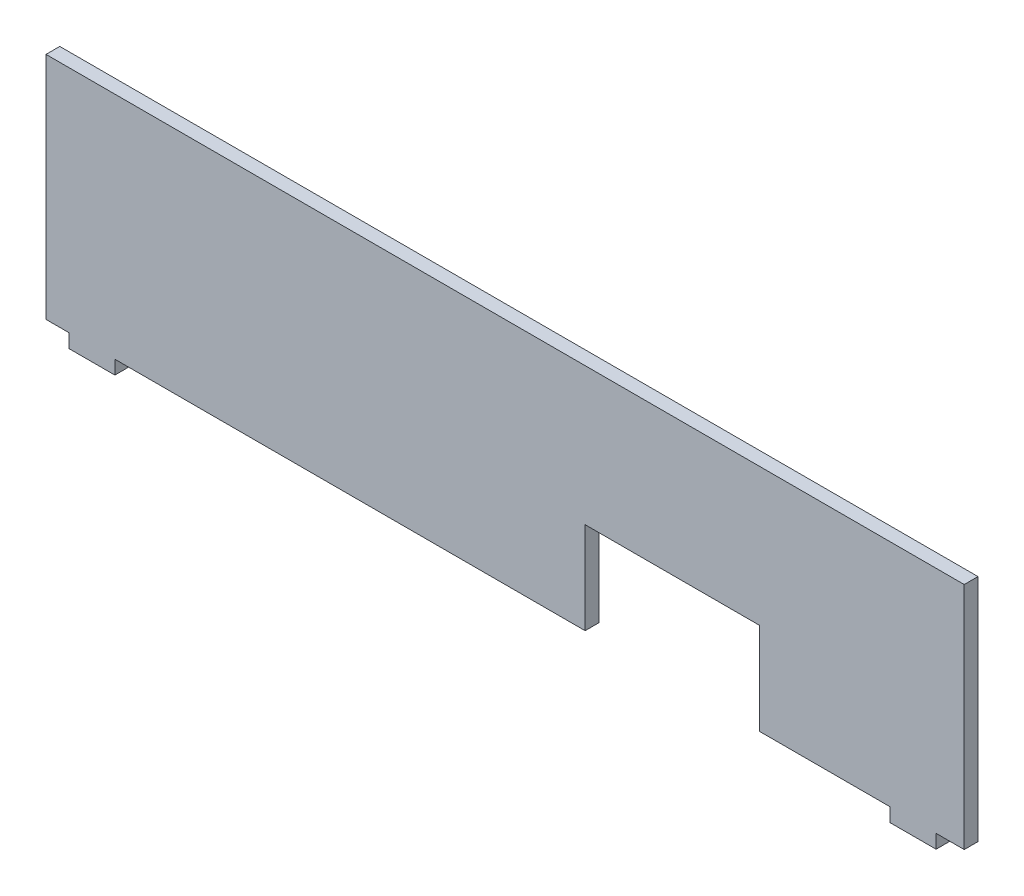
ISO-10303-21;
HEADER;
FILE_DESCRIPTION(('STEP AP214'),'2;1');
FILE_NAME('part.step','',(''),(''),'','','');
FILE_SCHEMA(('AUTOMOTIVE_DESIGN { 1 0 10303 214 1 1 1 1 }'));
ENDSEC;
DATA;
#1=APPLICATION_CONTEXT('core data for automotive mechanical design processes');
#2=APPLICATION_PROTOCOL_DEFINITION('international standard','automotive_design',2000,#1);
#3=PRODUCT_CONTEXT('',#1,'mechanical');
#4=PRODUCT('Part','Part','',(#3));
#5=PRODUCT_RELATED_PRODUCT_CATEGORY('part','',(#4));
#6=PRODUCT_DEFINITION_FORMATION('','',#4);
#7=PRODUCT_DEFINITION_CONTEXT('part definition',#1,'design');
#8=PRODUCT_DEFINITION('design','',#6,#7);
#9=PRODUCT_DEFINITION_SHAPE('','',#8);
#10=(LENGTH_UNIT() NAMED_UNIT(*) SI_UNIT(.MILLI.,.METRE.));
#11=(NAMED_UNIT(*) PLANE_ANGLE_UNIT() SI_UNIT($,.RADIAN.));
#12=(NAMED_UNIT(*) SI_UNIT($,.STERADIAN.) SOLID_ANGLE_UNIT());
#13=UNCERTAINTY_MEASURE_WITH_UNIT(LENGTH_MEASURE(1.E-05),#10,'distance_accuracy_value','');
#14=(GEOMETRIC_REPRESENTATION_CONTEXT(3) GLOBAL_UNCERTAINTY_ASSIGNED_CONTEXT((#13)) GLOBAL_UNIT_ASSIGNED_CONTEXT((#10,
#11,#12)) REPRESENTATION_CONTEXT('',''));
#15=CARTESIAN_POINT('',(0.,0.,0.));
#16=DIRECTION('',(0.,0.,1.));
#17=DIRECTION('',(1.,0.,0.));
#18=AXIS2_PLACEMENT_3D('',#15,#16,#17);
#19=CARTESIAN_POINT('',(-62.4906588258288,-16.8654181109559,3.));
#20=DIRECTION('',(1.,0.,0.));
#21=DIRECTION('',(0.,0.,-1.));
#22=AXIS2_PLACEMENT_3D('',#19,#20,#21);
#23=PLANE('',#22);
#24=DIRECTION('',(0.,-1.,0.));
#25=VECTOR('',#24,1.);
#26=CARTESIAN_POINT('',(-62.4906588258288,-16.8654181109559,0.));
#27=LINE('',#26,#25);
#28=CARTESIAN_POINT('',(-62.4906588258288,33.1345818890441,0.));
#29=VERTEX_POINT('',#28);
#30=CARTESIAN_POINT('',(-62.4906588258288,-16.8654181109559,0.));
#31=VERTEX_POINT('',#30);
#32=EDGE_CURVE('E177',#29,#31,#27,.T.);
#33=ORIENTED_EDGE('',*,*,#32,.T.);
#34=DIRECTION('',(0.,0.,-1.));
#35=VECTOR('',#34,1.);
#36=CARTESIAN_POINT('',(-62.4906588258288,-16.8654181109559,3.));
#37=LINE('',#36,#35);
#38=CARTESIAN_POINT('',(-62.4906588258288,-16.8654181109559,3.));
#39=VERTEX_POINT('',#38);
#40=EDGE_CURVE('E11',#39,#31,#37,.T.);
#41=ORIENTED_EDGE('',*,*,#40,.F.);
#42=DIRECTION('',(0.,-1.,0.));
#43=VECTOR('',#42,1.);
#44=CARTESIAN_POINT('',(-62.4906588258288,-16.8654181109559,3.));
#45=LINE('',#44,#43);
#46=CARTESIAN_POINT('',(-62.4906588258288,33.1345818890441,3.));
#47=VERTEX_POINT('',#46);
#48=EDGE_CURVE('E207',#47,#39,#45,.T.);
#49=ORIENTED_EDGE('',*,*,#48,.F.);
#50=DIRECTION('',(0.,0.,-1.));
#51=VECTOR('',#50,1.);
#52=CARTESIAN_POINT('',(-62.4906588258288,33.1345818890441,3.));
#53=LINE('',#52,#51);
#54=EDGE_CURVE('E173',#47,#29,#53,.T.);
#55=ORIENTED_EDGE('',*,*,#54,.T.);
#56=EDGE_LOOP('',(#33,#41,#49,#55));
#57=FACE_BOUND('',#56,.T.);
#58=ADVANCED_FACE('F33',(#57),#23,.F.);
#59=CARTESIAN_POINT('',(-62.4906588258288,-16.8654181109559,3.));
#60=DIRECTION('',(0.,1.,0.));
#61=DIRECTION('',(-1.,0.,0.));
#62=AXIS2_PLACEMENT_3D('',#59,#60,#61);
#63=PLANE('',#62);
#64=DIRECTION('',(1.,0.,0.));
#65=VECTOR('',#64,1.);
#66=CARTESIAN_POINT('',(-62.4906588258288,-16.8654181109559,0.));
#67=LINE('',#66,#65);
#68=CARTESIAN_POINT('',(-57.4906588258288,-16.8654181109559,0.));
#69=VERTEX_POINT('',#68);
#70=EDGE_CURVE('E180',#31,#69,#67,.T.);
#71=ORIENTED_EDGE('',*,*,#70,.T.);
#72=DIRECTION('',(0.,0.,-1.));
#73=VECTOR('',#72,1.);
#74=CARTESIAN_POINT('',(-57.4906588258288,-16.8654181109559,3.));
#75=LINE('',#74,#73);
#76=CARTESIAN_POINT('',(-57.4906588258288,-16.8654181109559,3.));
#77=VERTEX_POINT('',#76);
#78=EDGE_CURVE('E41',#77,#69,#75,.T.);
#79=ORIENTED_EDGE('',*,*,#78,.F.);
#80=DIRECTION('',(1.,0.,0.));
#81=VECTOR('',#80,1.);
#82=CARTESIAN_POINT('',(-62.4906588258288,-16.8654181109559,3.));
#83=LINE('',#82,#81);
#84=EDGE_CURVE('E116',#39,#77,#83,.T.);
#85=ORIENTED_EDGE('',*,*,#84,.F.);
#86=ORIENTED_EDGE('',*,*,#40,.T.);
#87=EDGE_LOOP('',(#71,#79,#85,#86));
#88=FACE_BOUND('',#87,.T.);
#89=ADVANCED_FACE('F305',(#88),#63,.F.);
#90=CARTESIAN_POINT('',(-57.4906588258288,-16.8654181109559,3.));
#91=DIRECTION('',(1.,0.,0.));
#92=DIRECTION('',(0.,0.,-1.));
#93=AXIS2_PLACEMENT_3D('',#90,#91,#92);
#94=PLANE('',#93);
#95=DIRECTION('',(0.,-1.,0.));
#96=VECTOR('',#95,1.);
#97=CARTESIAN_POINT('',(-57.4906588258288,-16.8654181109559,0.));
#98=LINE('',#97,#96);
#99=CARTESIAN_POINT('',(-57.4906588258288,-19.8654181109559,0.));
#100=VERTEX_POINT('',#99);
#101=EDGE_CURVE('E182',#69,#100,#98,.T.);
#102=ORIENTED_EDGE('',*,*,#101,.T.);
#103=DIRECTION('',(0.,0.,-1.));
#104=VECTOR('',#103,1.);
#105=CARTESIAN_POINT('',(-57.4906588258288,-19.8654181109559,3.));
#106=LINE('',#105,#104);
#107=CARTESIAN_POINT('',(-57.4906588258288,-19.8654181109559,3.));
#108=VERTEX_POINT('',#107);
#109=EDGE_CURVE('E238',#108,#100,#106,.T.);
#110=ORIENTED_EDGE('',*,*,#109,.F.);
#111=DIRECTION('',(0.,-1.,0.));
#112=VECTOR('',#111,1.);
#113=CARTESIAN_POINT('',(-57.4906588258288,-16.8654181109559,3.));
#114=LINE('',#113,#112);
#115=EDGE_CURVE('E246',#77,#108,#114,.T.);
#116=ORIENTED_EDGE('',*,*,#115,.F.);
#117=ORIENTED_EDGE('',*,*,#78,.T.);
#118=EDGE_LOOP('',(#102,#110,#116,#117));
#119=FACE_BOUND('',#118,.T.);
#120=ADVANCED_FACE('F244',(#119),#94,.F.);
#121=CARTESIAN_POINT('',(-57.4906588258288,-19.8654181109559,3.));
#122=DIRECTION('',(0.,1.,0.));
#123=DIRECTION('',(0.,0.,1.));
#124=AXIS2_PLACEMENT_3D('',#121,#122,#123);
#125=PLANE('',#124);
#126=DIRECTION('',(1.,0.,0.));
#127=VECTOR('',#126,1.);
#128=CARTESIAN_POINT('',(-57.4906588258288,-19.8654181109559,0.));
#129=LINE('',#128,#127);
#130=CARTESIAN_POINT('',(-47.4906588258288,-19.8654181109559,0.));
#131=VERTEX_POINT('',#130);
#132=EDGE_CURVE('E184',#100,#131,#129,.T.);
#133=ORIENTED_EDGE('',*,*,#132,.T.);
#134=DIRECTION('',(0.,0.,-1.));
#135=VECTOR('',#134,1.);
#136=CARTESIAN_POINT('',(-47.4906588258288,-19.8654181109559,3.));
#137=LINE('',#136,#135);
#138=CARTESIAN_POINT('',(-47.4906588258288,-19.8654181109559,3.));
#139=VERTEX_POINT('',#138);
#140=EDGE_CURVE('E235',#139,#131,#137,.T.);
#141=ORIENTED_EDGE('',*,*,#140,.F.);
#142=DIRECTION('',(1.,0.,0.));
#143=VECTOR('',#142,1.);
#144=CARTESIAN_POINT('',(-57.4906588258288,-19.8654181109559,3.));
#145=LINE('',#144,#143);
#146=EDGE_CURVE('E264',#108,#139,#145,.T.);
#147=ORIENTED_EDGE('',*,*,#146,.F.);
#148=ORIENTED_EDGE('',*,*,#109,.T.);
#149=EDGE_LOOP('',(#133,#141,#147,#148));
#150=FACE_BOUND('',#149,.T.);
#151=ADVANCED_FACE('F255',(#150),#125,.F.);
#152=CARTESIAN_POINT('',(-47.4906588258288,-19.8654181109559,3.));
#153=DIRECTION('',(-1.,0.,0.));
#154=DIRECTION('',(0.,-1.,0.));
#155=AXIS2_PLACEMENT_3D('',#152,#153,#154);
#156=PLANE('',#155);
#157=DIRECTION('',(0.,1.,0.));
#158=VECTOR('',#157,1.);
#159=CARTESIAN_POINT('',(-47.4906588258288,-19.8654181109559,0.));
#160=LINE('',#159,#158);
#161=CARTESIAN_POINT('',(-47.4906588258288,-16.8654181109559,0.));
#162=VERTEX_POINT('',#161);
#163=EDGE_CURVE('E186',#131,#162,#160,.T.);
#164=ORIENTED_EDGE('',*,*,#163,.T.);
#165=DIRECTION('',(0.,0.,-1.));
#166=VECTOR('',#165,1.);
#167=CARTESIAN_POINT('',(-47.4906588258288,-16.8654181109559,3.));
#168=LINE('',#167,#166);
#169=CARTESIAN_POINT('',(-47.4906588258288,-16.8654181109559,3.));
#170=VERTEX_POINT('',#169);
#171=EDGE_CURVE('E232',#170,#162,#168,.T.);
#172=ORIENTED_EDGE('',*,*,#171,.F.);
#173=DIRECTION('',(0.,1.,0.));
#174=VECTOR('',#173,1.);
#175=CARTESIAN_POINT('',(-47.4906588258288,-19.8654181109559,3.));
#176=LINE('',#175,#174);
#177=EDGE_CURVE('E261',#139,#170,#176,.T.);
#178=ORIENTED_EDGE('',*,*,#177,.F.);
#179=ORIENTED_EDGE('',*,*,#140,.T.);
#180=EDGE_LOOP('',(#164,#172,#178,#179));
#181=FACE_BOUND('',#180,.T.);
#182=ADVANCED_FACE('F259',(#181),#156,.F.);
#183=CARTESIAN_POINT('',(-47.4906588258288,-16.8654181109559,3.));
#184=DIRECTION('',(0.,1.,0.));
#185=DIRECTION('',(0.,0.,1.));
#186=AXIS2_PLACEMENT_3D('',#183,#184,#185);
#187=PLANE('',#186);
#188=DIRECTION('',(1.,0.,0.));
#189=VECTOR('',#188,1.);
#190=CARTESIAN_POINT('',(-47.4906588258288,-16.8654181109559,0.));
#191=LINE('',#190,#189);
#192=CARTESIAN_POINT('',(54.9397347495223,-16.8654181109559,0.));
#193=VERTEX_POINT('',#192);
#194=EDGE_CURVE('E188',#162,#193,#191,.T.);
#195=ORIENTED_EDGE('',*,*,#194,.T.);
#196=DIRECTION('',(0.,0.,-1.));
#197=VECTOR('',#196,1.);
#198=CARTESIAN_POINT('',(54.9397347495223,-16.8654181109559,3.));
#199=LINE('',#198,#197);
#200=CARTESIAN_POINT('',(54.9397347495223,-16.8654181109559,3.));
#201=VERTEX_POINT('',#200);
#202=EDGE_CURVE('E229',#201,#193,#199,.T.);
#203=ORIENTED_EDGE('',*,*,#202,.F.);
#204=DIRECTION('',(1.,0.,0.));
#205=VECTOR('',#204,1.);
#206=CARTESIAN_POINT('',(-47.4906588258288,-16.8654181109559,3.));
#207=LINE('',#206,#205);
#208=EDGE_CURVE('E263',#170,#201,#207,.T.);
#209=ORIENTED_EDGE('',*,*,#208,.F.);
#210=ORIENTED_EDGE('',*,*,#171,.T.);
#211=EDGE_LOOP('',(#195,#203,#209,#210));
#212=FACE_BOUND('',#211,.T.);
#213=ADVANCED_FACE('F318',(#212),#187,.F.);
#214=CARTESIAN_POINT('',(54.9397347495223,3.1345818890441,3.));
#215=DIRECTION('',(-1.,0.,0.));
#216=DIRECTION('',(0.,0.,1.));
#217=AXIS2_PLACEMENT_3D('',#214,#215,#216);
#218=PLANE('',#217);
#219=DIRECTION('',(0.,1.,0.));
#220=VECTOR('',#219,1.);
#221=CARTESIAN_POINT('',(54.9397347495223,3.1345818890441,0.));
#222=LINE('',#221,#220);
#223=CARTESIAN_POINT('',(54.9397347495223,3.1345818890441,0.));
#224=VERTEX_POINT('',#223);
#225=EDGE_CURVE('E190',#193,#224,#222,.T.);
#226=ORIENTED_EDGE('',*,*,#225,.T.);
#227=DIRECTION('',(0.,0.,-1.));
#228=VECTOR('',#227,1.);
#229=CARTESIAN_POINT('',(54.9397347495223,3.1345818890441,3.));
#230=LINE('',#229,#228);
#231=CARTESIAN_POINT('',(54.9397347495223,3.1345818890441,3.));
#232=VERTEX_POINT('',#231);
#233=EDGE_CURVE('E226',#232,#224,#230,.T.);
#234=ORIENTED_EDGE('',*,*,#233,.F.);
#235=DIRECTION('',(0.,1.,0.));
#236=VECTOR('',#235,1.);
#237=CARTESIAN_POINT('',(54.9397347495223,3.1345818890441,3.));
#238=LINE('',#237,#236);
#239=EDGE_CURVE('E266',#201,#232,#238,.T.);
#240=ORIENTED_EDGE('',*,*,#239,.F.);
#241=ORIENTED_EDGE('',*,*,#202,.T.);
#242=EDGE_LOOP('',(#226,#234,#240,#241));
#243=FACE_BOUND('',#242,.T.);
#244=ADVANCED_FACE('F321',(#243),#218,.F.);
#245=CARTESIAN_POINT('',(92.9397347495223,3.1345818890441,3.));
#246=DIRECTION('',(0.,1.,0.));
#247=DIRECTION('',(0.,0.,1.));
#248=AXIS2_PLACEMENT_3D('',#245,#246,#247);
#249=PLANE('',#248);
#250=DIRECTION('',(1.,0.,0.));
#251=VECTOR('',#250,1.);
#252=CARTESIAN_POINT('',(92.9397347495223,3.1345818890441,0.));
#253=LINE('',#252,#251);
#254=CARTESIAN_POINT('',(92.9397347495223,3.1345818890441,0.));
#255=VERTEX_POINT('',#254);
#256=EDGE_CURVE('E192',#224,#255,#253,.T.);
#257=ORIENTED_EDGE('',*,*,#256,.T.);
#258=DIRECTION('',(0.,0.,-1.));
#259=VECTOR('',#258,1.);
#260=CARTESIAN_POINT('',(92.9397347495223,3.1345818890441,3.));
#261=LINE('',#260,#259);
#262=CARTESIAN_POINT('',(92.9397347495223,3.1345818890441,3.));
#263=VERTEX_POINT('',#262);
#264=EDGE_CURVE('E223',#263,#255,#261,.T.);
#265=ORIENTED_EDGE('',*,*,#264,.F.);
#266=DIRECTION('',(1.,0.,0.));
#267=VECTOR('',#266,1.);
#268=CARTESIAN_POINT('',(92.9397347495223,3.1345818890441,3.));
#269=LINE('',#268,#267);
#270=EDGE_CURVE('E272',#232,#263,#269,.T.);
#271=ORIENTED_EDGE('',*,*,#270,.F.);
#272=ORIENTED_EDGE('',*,*,#233,.T.);
#273=EDGE_LOOP('',(#257,#265,#271,#272));
#274=FACE_BOUND('',#273,.T.);
#275=ADVANCED_FACE('F325',(#274),#249,.F.);
#276=CARTESIAN_POINT('',(92.9397347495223,-16.8654181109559,3.));
#277=DIRECTION('',(1.,0.,0.));
#278=DIRECTION('',(0.,0.,-1.));
#279=AXIS2_PLACEMENT_3D('',#276,#277,#278);
#280=PLANE('',#279);
#281=DIRECTION('',(0.,-1.,0.));
#282=VECTOR('',#281,1.);
#283=CARTESIAN_POINT('',(92.9397347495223,-16.8654181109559,0.));
#284=LINE('',#283,#282);
#285=CARTESIAN_POINT('',(92.9397347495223,-16.8654181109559,0.));
#286=VERTEX_POINT('',#285);
#287=EDGE_CURVE('E194',#255,#286,#284,.T.);
#288=ORIENTED_EDGE('',*,*,#287,.T.);
#289=DIRECTION('',(0.,0.,-1.));
#290=VECTOR('',#289,1.);
#291=CARTESIAN_POINT('',(92.9397347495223,-16.8654181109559,3.));
#292=LINE('',#291,#290);
#293=CARTESIAN_POINT('',(92.9397347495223,-16.8654181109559,3.));
#294=VERTEX_POINT('',#293);
#295=EDGE_CURVE('E220',#294,#286,#292,.T.);
#296=ORIENTED_EDGE('',*,*,#295,.F.);
#297=DIRECTION('',(0.,-1.,0.));
#298=VECTOR('',#297,1.);
#299=CARTESIAN_POINT('',(92.9397347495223,-16.8654181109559,3.));
#300=LINE('',#299,#298);
#301=EDGE_CURVE('E274',#263,#294,#300,.T.);
#302=ORIENTED_EDGE('',*,*,#301,.F.);
#303=ORIENTED_EDGE('',*,*,#264,.T.);
#304=EDGE_LOOP('',(#288,#296,#302,#303));
#305=FACE_BOUND('',#304,.T.);
#306=ADVANCED_FACE('F329',(#305),#280,.F.);
#307=CARTESIAN_POINT('',(92.9397347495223,-16.8654181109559,3.));
#308=DIRECTION('',(0.,1.,0.));
#309=DIRECTION('',(0.,0.,1.));
#310=AXIS2_PLACEMENT_3D('',#307,#308,#309);
#311=PLANE('',#310);
#312=DIRECTION('',(1.,0.,0.));
#313=VECTOR('',#312,1.);
#314=CARTESIAN_POINT('',(92.9397347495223,-16.8654181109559,0.));
#315=LINE('',#314,#313);
#316=CARTESIAN_POINT('',(121.379341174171,-16.8654181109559,0.));
#317=VERTEX_POINT('',#316);
#318=EDGE_CURVE('E196',#286,#317,#315,.T.);
#319=ORIENTED_EDGE('',*,*,#318,.T.);
#320=DIRECTION('',(0.,0.,-1.));
#321=VECTOR('',#320,1.);
#322=CARTESIAN_POINT('',(121.379341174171,-16.8654181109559,3.));
#323=LINE('',#322,#321);
#324=CARTESIAN_POINT('',(121.379341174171,-16.8654181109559,3.));
#325=VERTEX_POINT('',#324);
#326=EDGE_CURVE('E217',#325,#317,#323,.T.);
#327=ORIENTED_EDGE('',*,*,#326,.F.);
#328=DIRECTION('',(1.,0.,0.));
#329=VECTOR('',#328,1.);
#330=CARTESIAN_POINT('',(92.9397347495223,-16.8654181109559,3.));
#331=LINE('',#330,#329);
#332=EDGE_CURVE('E276',#294,#325,#331,.T.);
#333=ORIENTED_EDGE('',*,*,#332,.F.);
#334=ORIENTED_EDGE('',*,*,#295,.T.);
#335=EDGE_LOOP('',(#319,#327,#333,#334));
#336=FACE_BOUND('',#335,.T.);
#337=ADVANCED_FACE('F333',(#336),#311,.F.);
#338=CARTESIAN_POINT('',(121.379341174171,-19.8654181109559,3.));
#339=DIRECTION('',(1.,0.,0.));
#340=DIRECTION('',(0.,0.,-1.));
#341=AXIS2_PLACEMENT_3D('',#338,#339,#340);
#342=PLANE('',#341);
#343=DIRECTION('',(0.,-1.,0.));
#344=VECTOR('',#343,1.);
#345=CARTESIAN_POINT('',(121.379341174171,-19.8654181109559,0.));
#346=LINE('',#345,#344);
#347=CARTESIAN_POINT('',(121.379341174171,-19.8654181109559,0.));
#348=VERTEX_POINT('',#347);
#349=EDGE_CURVE('E198',#317,#348,#346,.T.);
#350=ORIENTED_EDGE('',*,*,#349,.T.);
#351=DIRECTION('',(0.,0.,-1.));
#352=VECTOR('',#351,1.);
#353=CARTESIAN_POINT('',(121.379341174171,-19.8654181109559,3.));
#354=LINE('',#353,#352);
#355=CARTESIAN_POINT('',(121.379341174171,-19.8654181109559,3.));
#356=VERTEX_POINT('',#355);
#357=EDGE_CURVE('E214',#356,#348,#354,.T.);
#358=ORIENTED_EDGE('',*,*,#357,.F.);
#359=DIRECTION('',(0.,-1.,0.));
#360=VECTOR('',#359,1.);
#361=CARTESIAN_POINT('',(121.379341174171,-19.8654181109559,3.));
#362=LINE('',#361,#360);
#363=EDGE_CURVE('E278',#325,#356,#362,.T.);
#364=ORIENTED_EDGE('',*,*,#363,.F.);
#365=ORIENTED_EDGE('',*,*,#326,.T.);
#366=EDGE_LOOP('',(#350,#358,#364,#365));
#367=FACE_BOUND('',#366,.T.);
#368=ADVANCED_FACE('F337',(#367),#342,.F.);
#369=CARTESIAN_POINT('',(131.379341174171,-19.8654181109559,3.));
#370=DIRECTION('',(0.,1.,0.));
#371=DIRECTION('',(0.,0.,1.));
#372=AXIS2_PLACEMENT_3D('',#369,#370,#371);
#373=PLANE('',#372);
#374=DIRECTION('',(1.,0.,0.));
#375=VECTOR('',#374,1.);
#376=CARTESIAN_POINT('',(131.379341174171,-19.8654181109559,0.));
#377=LINE('',#376,#375);
#378=CARTESIAN_POINT('',(131.379341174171,-19.8654181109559,0.));
#379=VERTEX_POINT('',#378);
#380=EDGE_CURVE('E200',#348,#379,#377,.T.);
#381=ORIENTED_EDGE('',*,*,#380,.T.);
#382=DIRECTION('',(0.,0.,-1.));
#383=VECTOR('',#382,1.);
#384=CARTESIAN_POINT('',(131.379341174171,-19.8654181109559,3.));
#385=LINE('',#384,#383);
#386=CARTESIAN_POINT('',(131.379341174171,-19.8654181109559,3.));
#387=VERTEX_POINT('',#386);
#388=EDGE_CURVE('E211',#387,#379,#385,.T.);
#389=ORIENTED_EDGE('',*,*,#388,.F.);
#390=DIRECTION('',(1.,0.,0.));
#391=VECTOR('',#390,1.);
#392=CARTESIAN_POINT('',(131.379341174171,-19.8654181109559,3.));
#393=LINE('',#392,#391);
#394=EDGE_CURVE('E280',#356,#387,#393,.T.);
#395=ORIENTED_EDGE('',*,*,#394,.F.);
#396=ORIENTED_EDGE('',*,*,#357,.T.);
#397=EDGE_LOOP('',(#381,#389,#395,#396));
#398=FACE_BOUND('',#397,.T.);
#399=ADVANCED_FACE('F286',(#398),#373,.F.);
#400=CARTESIAN_POINT('',(131.379341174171,-16.8654181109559,3.));
#401=DIRECTION('',(-1.,0.,0.));
#402=DIRECTION('',(0.,0.,1.));
#403=AXIS2_PLACEMENT_3D('',#400,#401,#402);
#404=PLANE('',#403);
#405=DIRECTION('',(0.,1.,0.));
#406=VECTOR('',#405,1.);
#407=CARTESIAN_POINT('',(131.379341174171,-16.8654181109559,0.));
#408=LINE('',#407,#406);
#409=CARTESIAN_POINT('',(131.379341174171,-16.8654181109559,0.));
#410=VERTEX_POINT('',#409);
#411=EDGE_CURVE('E202',#379,#410,#408,.T.);
#412=ORIENTED_EDGE('',*,*,#411,.T.);
#413=DIRECTION('',(0.,0.,-1.));
#414=VECTOR('',#413,1.);
#415=CARTESIAN_POINT('',(131.379341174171,-16.8654181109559,3.));
#416=LINE('',#415,#414);
#417=CARTESIAN_POINT('',(131.379341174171,-16.8654181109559,3.));
#418=VERTEX_POINT('',#417);
#419=EDGE_CURVE('E168',#418,#410,#416,.T.);
#420=ORIENTED_EDGE('',*,*,#419,.F.);
#421=DIRECTION('',(0.,1.,0.));
#422=VECTOR('',#421,1.);
#423=CARTESIAN_POINT('',(131.379341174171,-16.8654181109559,3.));
#424=LINE('',#423,#422);
#425=EDGE_CURVE('E159',#387,#418,#424,.T.);
#426=ORIENTED_EDGE('',*,*,#425,.F.);
#427=ORIENTED_EDGE('',*,*,#388,.T.);
#428=EDGE_LOOP('',(#412,#420,#426,#427));
#429=FACE_BOUND('',#428,.T.);
#430=ADVANCED_FACE('F290',(#429),#404,.F.);
#431=CARTESIAN_POINT('',(137.509341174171,-16.8654181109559,3.));
#432=DIRECTION('',(0.,1.,0.));
#433=DIRECTION('',(-1.,0.,0.));
#434=AXIS2_PLACEMENT_3D('',#431,#432,#433);
#435=PLANE('',#434);
#436=DIRECTION('',(1.,0.,0.));
#437=VECTOR('',#436,1.);
#438=CARTESIAN_POINT('',(137.509341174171,-16.8654181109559,0.));
#439=LINE('',#438,#437);
#440=CARTESIAN_POINT('',(137.509341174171,-16.8654181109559,0.));
#441=VERTEX_POINT('',#440);
#442=EDGE_CURVE('E167',#410,#441,#439,.T.);
#443=ORIENTED_EDGE('',*,*,#442,.T.);
#444=DIRECTION('',(0.,0.,-1.));
#445=VECTOR('',#444,1.);
#446=CARTESIAN_POINT('',(137.509341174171,-16.8654181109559,3.));
#447=LINE('',#446,#445);
#448=CARTESIAN_POINT('',(137.509341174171,-16.8654181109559,3.));
#449=VERTEX_POINT('',#448);
#450=EDGE_CURVE('E164',#449,#441,#447,.T.);
#451=ORIENTED_EDGE('',*,*,#450,.F.);
#452=DIRECTION('',(1.,0.,0.));
#453=VECTOR('',#452,1.);
#454=CARTESIAN_POINT('',(137.509341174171,-16.8654181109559,3.));
#455=LINE('',#454,#453);
#456=EDGE_CURVE('E153',#418,#449,#455,.T.);
#457=ORIENTED_EDGE('',*,*,#456,.F.);
#458=ORIENTED_EDGE('',*,*,#419,.T.);
#459=EDGE_LOOP('',(#443,#451,#457,#458));
#460=FACE_BOUND('',#459,.T.);
#461=ADVANCED_FACE('F165',(#460),#435,.F.);
#462=CARTESIAN_POINT('',(137.509341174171,33.1345818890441,3.));
#463=DIRECTION('',(-1.,0.,0.));
#464=DIRECTION('',(0.,0.,1.));
#465=AXIS2_PLACEMENT_3D('',#462,#463,#464);
#466=PLANE('',#465);
#467=DIRECTION('',(0.,1.,0.));
#468=VECTOR('',#467,1.);
#469=CARTESIAN_POINT('',(137.509341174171,33.1345818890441,0.));
#470=LINE('',#469,#468);
#471=CARTESIAN_POINT('',(137.509341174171,33.1345818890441,0.));
#472=VERTEX_POINT('',#471);
#473=EDGE_CURVE('E102',#441,#472,#470,.T.);
#474=ORIENTED_EDGE('',*,*,#473,.T.);
#475=DIRECTION('',(0.,0.,-1.));
#476=VECTOR('',#475,1.);
#477=CARTESIAN_POINT('',(137.509341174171,33.1345818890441,3.));
#478=LINE('',#477,#476);
#479=CARTESIAN_POINT('',(137.509341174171,33.1345818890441,3.));
#480=VERTEX_POINT('',#479);
#481=EDGE_CURVE('E169',#480,#472,#478,.T.);
#482=ORIENTED_EDGE('',*,*,#481,.F.);
#483=DIRECTION('',(0.,1.,0.));
#484=VECTOR('',#483,1.);
#485=CARTESIAN_POINT('',(137.509341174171,33.1345818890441,3.));
#486=LINE('',#485,#484);
#487=EDGE_CURVE('E157',#449,#480,#486,.T.);
#488=ORIENTED_EDGE('',*,*,#487,.F.);
#489=ORIENTED_EDGE('',*,*,#450,.T.);
#490=EDGE_LOOP('',(#474,#482,#488,#489));
#491=FACE_BOUND('',#490,.T.);
#492=ADVANCED_FACE('F171',(#491),#466,.F.);
#493=CARTESIAN_POINT('',(-62.4906588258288,33.1345818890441,3.));
#494=DIRECTION('',(0.,-1.,0.));
#495=DIRECTION('',(0.,0.,-1.));
#496=AXIS2_PLACEMENT_3D('',#493,#494,#495);
#497=PLANE('',#496);
#498=DIRECTION('',(-1.,0.,0.));
#499=VECTOR('',#498,1.);
#500=CARTESIAN_POINT('',(-62.4906588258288,33.1345818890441,0.));
#501=LINE('',#500,#499);
#502=EDGE_CURVE('E108',#472,#29,#501,.T.);
#503=ORIENTED_EDGE('',*,*,#502,.T.);
#504=ORIENTED_EDGE('',*,*,#54,.F.);
#505=DIRECTION('',(-1.,0.,0.));
#506=VECTOR('',#505,1.);
#507=CARTESIAN_POINT('',(-62.4906588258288,33.1345818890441,3.));
#508=LINE('',#507,#506);
#509=EDGE_CURVE('E49',#480,#47,#508,.T.);
#510=ORIENTED_EDGE('',*,*,#509,.F.);
#511=ORIENTED_EDGE('',*,*,#481,.T.);
#512=EDGE_LOOP('',(#503,#504,#510,#511));
#513=FACE_BOUND('',#512,.T.);
#514=ADVANCED_FACE('F294',(#513),#497,.F.);
#515=CARTESIAN_POINT('',(0.,0.,3.));
#516=DIRECTION('',(0.,0.,-1.));
#517=DIRECTION('',(-1.,0.,0.));
#518=AXIS2_PLACEMENT_3D('',#515,#516,#517);
#519=PLANE('',#518);
#520=ORIENTED_EDGE('',*,*,#48,.T.);
#521=ORIENTED_EDGE('',*,*,#84,.T.);
#522=ORIENTED_EDGE('',*,*,#115,.T.);
#523=ORIENTED_EDGE('',*,*,#146,.T.);
#524=ORIENTED_EDGE('',*,*,#177,.T.);
#525=ORIENTED_EDGE('',*,*,#208,.T.);
#526=ORIENTED_EDGE('',*,*,#239,.T.);
#527=ORIENTED_EDGE('',*,*,#270,.T.);
#528=ORIENTED_EDGE('',*,*,#301,.T.);
#529=ORIENTED_EDGE('',*,*,#332,.T.);
#530=ORIENTED_EDGE('',*,*,#363,.T.);
#531=ORIENTED_EDGE('',*,*,#394,.T.);
#532=ORIENTED_EDGE('',*,*,#425,.T.);
#533=ORIENTED_EDGE('',*,*,#456,.T.);
#534=ORIENTED_EDGE('',*,*,#487,.T.);
#535=ORIENTED_EDGE('',*,*,#509,.T.);
#536=EDGE_LOOP('',(#520,#521,#522,#523,#524,#525,#526,#527,#528,#529,#530,#531,#532,#533,#534,#535));
#537=FACE_BOUND('',#536,.T.);
#538=ADVANCED_FACE('F155',(#537),#519,.F.);
#539=CARTESIAN_POINT('',(0.,0.,0.));
#540=DIRECTION('',(0.,0.,-1.));
#541=DIRECTION('',(-1.,0.,0.));
#542=AXIS2_PLACEMENT_3D('',#539,#540,#541);
#543=PLANE('',#542);
#544=ORIENTED_EDGE('',*,*,#32,.F.);
#545=ORIENTED_EDGE('',*,*,#502,.F.);
#546=ORIENTED_EDGE('',*,*,#473,.F.);
#547=ORIENTED_EDGE('',*,*,#442,.F.);
#548=ORIENTED_EDGE('',*,*,#411,.F.);
#549=ORIENTED_EDGE('',*,*,#380,.F.);
#550=ORIENTED_EDGE('',*,*,#349,.F.);
#551=ORIENTED_EDGE('',*,*,#318,.F.);
#552=ORIENTED_EDGE('',*,*,#287,.F.);
#553=ORIENTED_EDGE('',*,*,#256,.F.);
#554=ORIENTED_EDGE('',*,*,#225,.F.);
#555=ORIENTED_EDGE('',*,*,#194,.F.);
#556=ORIENTED_EDGE('',*,*,#163,.F.);
#557=ORIENTED_EDGE('',*,*,#132,.F.);
#558=ORIENTED_EDGE('',*,*,#101,.F.);
#559=ORIENTED_EDGE('',*,*,#70,.F.);
#560=EDGE_LOOP('',(#544,#545,#546,#547,#548,#549,#550,#551,#552,#553,#554,#555,#556,#557,#558,#559));
#561=FACE_BOUND('',#560,.T.);
#562=ADVANCED_FACE('F250',(#561),#543,.T.);
#563=CLOSED_SHELL('',(#58,#89,#120,#151,#182,#213,#244,#275,#306,#337,#368,#399,#430,#461,#492,
#514,#538,#562));
#564=MANIFOLD_SOLID_BREP('B2',#563);
#565=ADVANCED_BREP_SHAPE_REPRESENTATION('',(#18,#564),#14);
#566=SHAPE_DEFINITION_REPRESENTATION(#9,#565);
ENDSEC;
END-ISO-10303-21;
